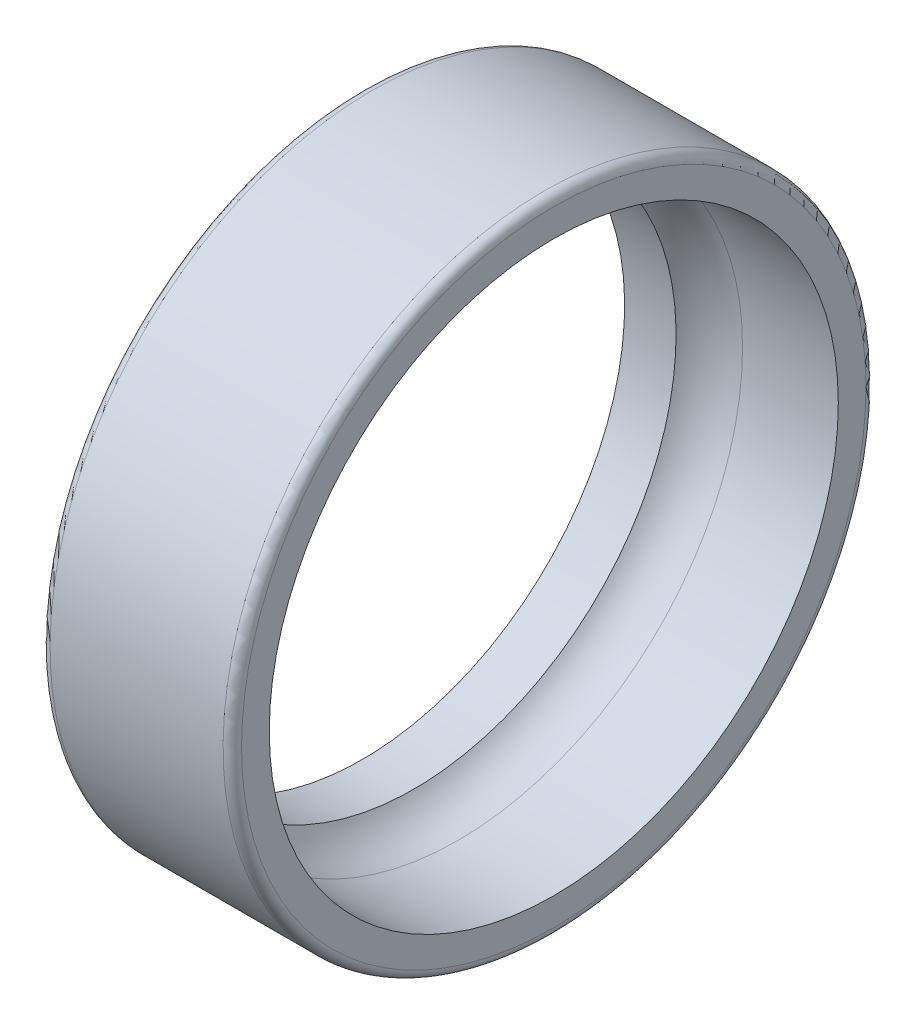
ISO-10303-21;
HEADER;
FILE_DESCRIPTION(('STEP AP214'),'2;1');
FILE_NAME('part.step','',(''),(''),'','','');
FILE_SCHEMA(('AUTOMOTIVE_DESIGN { 1 0 10303 214 1 1 1 1 }'));
ENDSEC;
DATA;
#1=APPLICATION_CONTEXT('core data for automotive mechanical design processes');
#2=APPLICATION_PROTOCOL_DEFINITION('international standard','automotive_design',2000,#1);
#3=PRODUCT_CONTEXT('',#1,'mechanical');
#4=PRODUCT('Part','Part','',(#3));
#5=PRODUCT_RELATED_PRODUCT_CATEGORY('part','',(#4));
#6=PRODUCT_DEFINITION_FORMATION('','',#4);
#7=PRODUCT_DEFINITION_CONTEXT('part definition',#1,'design');
#8=PRODUCT_DEFINITION('design','',#6,#7);
#9=PRODUCT_DEFINITION_SHAPE('','',#8);
#10=(LENGTH_UNIT() NAMED_UNIT(*) SI_UNIT(.MILLI.,.METRE.));
#11=(NAMED_UNIT(*) PLANE_ANGLE_UNIT() SI_UNIT($,.RADIAN.));
#12=(NAMED_UNIT(*) SI_UNIT($,.STERADIAN.) SOLID_ANGLE_UNIT());
#13=UNCERTAINTY_MEASURE_WITH_UNIT(LENGTH_MEASURE(1.E-05),#10,'distance_accuracy_value','');
#14=(GEOMETRIC_REPRESENTATION_CONTEXT(3) GLOBAL_UNCERTAINTY_ASSIGNED_CONTEXT((#13)) GLOBAL_UNIT_ASSIGNED_CONTEXT((#10,
#11,#12)) REPRESENTATION_CONTEXT('',''));
#15=CARTESIAN_POINT('',(0.,0.,0.));
#16=DIRECTION('',(0.,0.,1.));
#17=DIRECTION('',(1.,0.,0.));
#18=AXIS2_PLACEMENT_3D('',#15,#16,#17);
#19=CARTESIAN_POINT('',(0.,21.0025,0.));
#20=DIRECTION('',(-1.,0.,0.));
#21=DIRECTION('',(0.,0.,1.));
#22=AXIS2_PLACEMENT_3D('',#19,#20,#21);
#23=PLANE('',#22);
#24=CARTESIAN_POINT('',(0.,0.,0.));
#25=DIRECTION('',(-1.,0.,0.));
#26=DIRECTION('',(0.,1.,0.));
#27=AXIS2_PLACEMENT_3D('',#24,#25,#26);
#28=CIRCLE('',#27,19.18);
#29=CARTESIAN_POINT('',(0.,19.18,0.));
#30=VERTEX_POINT('',#29);
#31=EDGE_CURVE('E34',#30,#30,#28,.T.);
#32=ORIENTED_EDGE('',*,*,#31,.F.);
#33=EDGE_LOOP('',(#32));
#34=FACE_BOUND('',#33,.T.);
#35=CARTESIAN_POINT('',(0.,0.,0.));
#36=DIRECTION('',(-1.,0.,0.));
#37=DIRECTION('',(0.,1.,0.));
#38=AXIS2_PLACEMENT_3D('',#35,#36,#37);
#39=CIRCLE('',#38,22.825);
#40=CARTESIAN_POINT('',(0.,22.825,0.));
#41=VERTEX_POINT('',#40);
#42=EDGE_CURVE('E10',#41,#41,#39,.T.);
#43=ORIENTED_EDGE('',*,*,#42,.T.);
#44=EDGE_LOOP('',(#43));
#45=FACE_BOUND('',#44,.T.);
#46=ADVANCED_FACE('F15',(#34,#45),#23,.T.);
#47=CARTESIAN_POINT('',(14.,21.8125,0.));
#48=DIRECTION('',(1.,0.,0.));
#49=DIRECTION('',(0.,0.,-1.));
#50=AXIS2_PLACEMENT_3D('',#47,#48,#49);
#51=PLANE('',#50);
#52=CARTESIAN_POINT('',(14.,0.,0.));
#53=DIRECTION('',(-1.,0.,0.));
#54=DIRECTION('',(0.,1.,0.));
#55=AXIS2_PLACEMENT_3D('',#52,#53,#54);
#56=CIRCLE('',#55,20.8);
#57=CARTESIAN_POINT('',(14.,20.8,0.));
#58=VERTEX_POINT('',#57);
#59=EDGE_CURVE('E24',#58,#58,#56,.T.);
#60=ORIENTED_EDGE('',*,*,#59,.T.);
#61=EDGE_LOOP('',(#60));
#62=FACE_BOUND('',#61,.T.);
#63=CARTESIAN_POINT('',(14.,0.,0.));
#64=DIRECTION('',(-1.,0.,0.));
#65=DIRECTION('',(0.,1.,0.));
#66=AXIS2_PLACEMENT_3D('',#63,#64,#65);
#67=CIRCLE('',#66,22.825);
#68=CARTESIAN_POINT('',(14.,22.825,0.));
#69=VERTEX_POINT('',#68);
#70=EDGE_CURVE('E44',#69,#69,#67,.T.);
#71=ORIENTED_EDGE('',*,*,#70,.F.);
#72=EDGE_LOOP('',(#71));
#73=FACE_BOUND('',#72,.T.);
#74=ADVANCED_FACE('F57',(#62,#73),#51,.T.);
#75=CARTESIAN_POINT('',(1.88,0.,0.));
#76=DIRECTION('',(-1.,0.,0.));
#77=DIRECTION('',(0.,0.,1.));
#78=AXIS2_PLACEMENT_3D('',#75,#76,#77);
#79=CYLINDRICAL_SURFACE('',#78,19.18);
#80=CARTESIAN_POINT('',(3.76,0.,0.));
#81=DIRECTION('',(-1.,0.,0.));
#82=DIRECTION('',(0.,1.,0.));
#83=AXIS2_PLACEMENT_3D('',#80,#81,#82);
#84=CIRCLE('',#83,19.18);
#85=CARTESIAN_POINT('',(3.76,19.18,0.));
#86=VERTEX_POINT('',#85);
#87=EDGE_CURVE('E38',#86,#86,#84,.T.);
#88=ORIENTED_EDGE('',*,*,#87,.F.);
#89=EDGE_LOOP('',(#88));
#90=FACE_BOUND('',#89,.T.);
#91=ORIENTED_EDGE('',*,*,#31,.T.);
#92=EDGE_LOOP('',(#91));
#93=FACE_BOUND('',#92,.T.);
#94=ADVANCED_FACE('F55',(#90,#93),#79,.F.);
#95=CARTESIAN_POINT('',(7.00000000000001,0.,0.));
#96=DIRECTION('',(-1.,0.,0.));
#97=DIRECTION('',(0.,0.,1.));
#98=AXIS2_PLACEMENT_3D('',#95,#96,#97);
#99=TOROIDAL_SURFACE('',#98,16.75,4.05000000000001);
#100=ORIENTED_EDGE('',*,*,#87,.T.);
#101=EDGE_LOOP('',(#100));
#102=FACE_BOUND('',#101,.T.);
#103=CARTESIAN_POINT('',(7.,0.,0.));
#104=DIRECTION('',(-1.,0.,0.));
#105=DIRECTION('',(0.,1.,0.));
#106=AXIS2_PLACEMENT_3D('',#103,#104,#105);
#107=CIRCLE('',#106,20.8);
#108=CARTESIAN_POINT('',(7.,20.8,0.));
#109=VERTEX_POINT('',#108);
#110=EDGE_CURVE('E47',#109,#109,#107,.T.);
#111=ORIENTED_EDGE('',*,*,#110,.F.);
#112=EDGE_LOOP('',(#111));
#113=FACE_BOUND('',#112,.T.);
#114=ADVANCED_FACE('F51',(#102,#113),#99,.F.);
#115=CARTESIAN_POINT('',(10.5,0.,0.));
#116=DIRECTION('',(-1.,0.,0.));
#117=DIRECTION('',(0.,0.,1.));
#118=AXIS2_PLACEMENT_3D('',#115,#116,#117);
#119=CYLINDRICAL_SURFACE('',#118,20.8);
#120=ORIENTED_EDGE('',*,*,#59,.F.);
#121=EDGE_LOOP('',(#120));
#122=FACE_BOUND('',#121,.T.);
#123=ORIENTED_EDGE('',*,*,#110,.T.);
#124=EDGE_LOOP('',(#123));
#125=FACE_BOUND('',#124,.T.);
#126=ADVANCED_FACE('F17',(#122,#125),#119,.F.);
#127=CARTESIAN_POINT('',(13.325,0.,0.));
#128=DIRECTION('',(-1.,0.,0.));
#129=DIRECTION('',(0.,0.,1.));
#130=AXIS2_PLACEMENT_3D('',#127,#128,#129);
#131=TOROIDAL_SURFACE('',#130,22.825,0.675000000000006);
#132=ORIENTED_EDGE('',*,*,#70,.T.);
#133=EDGE_LOOP('',(#132));
#134=FACE_BOUND('',#133,.T.);
#135=CARTESIAN_POINT('',(13.325,0.,0.));
#136=DIRECTION('',(-1.,0.,0.));
#137=DIRECTION('',(0.,1.,0.));
#138=AXIS2_PLACEMENT_3D('',#135,#136,#137);
#139=CIRCLE('',#138,23.5);
#140=CARTESIAN_POINT('',(13.325,23.5,0.));
#141=VERTEX_POINT('',#140);
#142=EDGE_CURVE('E43',#141,#141,#139,.T.);
#143=ORIENTED_EDGE('',*,*,#142,.F.);
#144=EDGE_LOOP('',(#143));
#145=FACE_BOUND('',#144,.T.);
#146=ADVANCED_FACE('F59',(#134,#145),#131,.T.);
#147=CARTESIAN_POINT('',(7.,0.,0.));
#148=DIRECTION('',(-1.,0.,0.));
#149=DIRECTION('',(0.,0.,1.));
#150=AXIS2_PLACEMENT_3D('',#147,#148,#149);
#151=CYLINDRICAL_SURFACE('',#150,23.5);
#152=CARTESIAN_POINT('',(0.675000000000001,0.,0.));
#153=DIRECTION('',(-1.,0.,0.));
#154=DIRECTION('',(0.,1.,0.));
#155=AXIS2_PLACEMENT_3D('',#152,#153,#154);
#156=CIRCLE('',#155,23.5);
#157=CARTESIAN_POINT('',(0.675000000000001,23.5,0.));
#158=VERTEX_POINT('',#157);
#159=EDGE_CURVE('E39',#158,#158,#156,.T.);
#160=ORIENTED_EDGE('',*,*,#159,.F.);
#161=EDGE_LOOP('',(#160));
#162=FACE_BOUND('',#161,.T.);
#163=ORIENTED_EDGE('',*,*,#142,.T.);
#164=EDGE_LOOP('',(#163));
#165=FACE_BOUND('',#164,.T.);
#166=ADVANCED_FACE('F62',(#162,#165),#151,.T.);
#167=CARTESIAN_POINT('',(0.675,0.,0.));
#168=DIRECTION('',(-1.,0.,0.));
#169=DIRECTION('',(0.,0.,1.));
#170=AXIS2_PLACEMENT_3D('',#167,#168,#169);
#171=TOROIDAL_SURFACE('',#170,22.825,0.675000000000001);
#172=ORIENTED_EDGE('',*,*,#159,.T.);
#173=EDGE_LOOP('',(#172));
#174=FACE_BOUND('',#173,.T.);
#175=ORIENTED_EDGE('',*,*,#42,.F.);
#176=EDGE_LOOP('',(#175));
#177=FACE_BOUND('',#176,.T.);
#178=ADVANCED_FACE('F66',(#174,#177),#171,.T.);
#179=CLOSED_SHELL('',(#46,#74,#94,#114,#126,#146,#166,#178));
#180=MANIFOLD_SOLID_BREP('B1',#179);
#181=ADVANCED_BREP_SHAPE_REPRESENTATION('',(#18,#180),#14);
#182=SHAPE_DEFINITION_REPRESENTATION(#9,#181);
ENDSEC;
END-ISO-10303-21;
